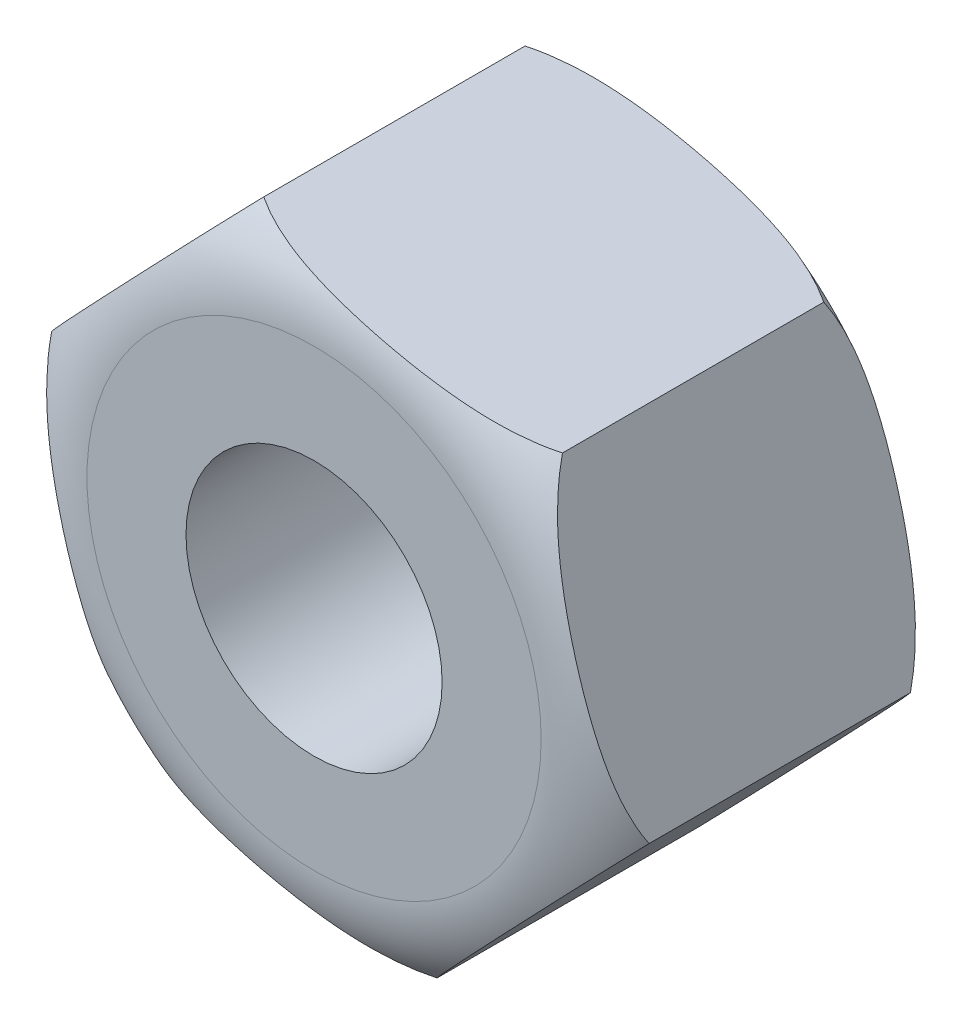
ISO-10303-21;
HEADER;
FILE_DESCRIPTION(('STEP AP214'),'2;1');
FILE_NAME('part.step','',(''),(''),'','','');
FILE_SCHEMA(('AUTOMOTIVE_DESIGN { 1 0 10303 214 1 1 1 1 }'));
ENDSEC;
DATA;
#1=APPLICATION_CONTEXT('core data for automotive mechanical design processes');
#2=APPLICATION_PROTOCOL_DEFINITION('international standard','automotive_design',2000,#1);
#3=PRODUCT_CONTEXT('',#1,'mechanical');
#4=PRODUCT('Part','Part','',(#3));
#5=PRODUCT_RELATED_PRODUCT_CATEGORY('part','',(#4));
#6=PRODUCT_DEFINITION_FORMATION('','',#4);
#7=PRODUCT_DEFINITION_CONTEXT('part definition',#1,'design');
#8=PRODUCT_DEFINITION('design','',#6,#7);
#9=PRODUCT_DEFINITION_SHAPE('','',#8);
#10=(LENGTH_UNIT() NAMED_UNIT(*) SI_UNIT(.MILLI.,.METRE.));
#11=(NAMED_UNIT(*) PLANE_ANGLE_UNIT() SI_UNIT($,.RADIAN.));
#12=(NAMED_UNIT(*) SI_UNIT($,.STERADIAN.) SOLID_ANGLE_UNIT());
#13=UNCERTAINTY_MEASURE_WITH_UNIT(LENGTH_MEASURE(1.E-05),#10,'distance_accuracy_value','');
#14=(GEOMETRIC_REPRESENTATION_CONTEXT(3) GLOBAL_UNCERTAINTY_ASSIGNED_CONTEXT((#13)) GLOBAL_UNIT_ASSIGNED_CONTEXT((#10,
#11,#12)) REPRESENTATION_CONTEXT('',''));
#15=CARTESIAN_POINT('',(0.,0.,0.));
#16=DIRECTION('',(0.,0.,1.));
#17=DIRECTION('',(1.,0.,0.));
#18=AXIS2_PLACEMENT_3D('',#15,#16,#17);
#19=CARTESIAN_POINT('',(0.,0.,8.));
#20=DIRECTION('',(0.,0.,1.));
#21=DIRECTION('',(1.,0.,0.));
#22=AXIS2_PLACEMENT_3D('',#19,#20,#21);
#23=TOROIDAL_SURFACE('',#22,17.,8.);
#24=CARTESIAN_POINT('',(-22.3612669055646,5.42193381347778,2.71895590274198));
#25=CARTESIAN_POINT('',(-22.3195071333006,5.27978053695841,2.63466784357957));
#26=CARTESIAN_POINT('',(-22.2771790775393,5.13569278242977,2.55401468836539));
#27=CARTESIAN_POINT('',(-22.1915556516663,4.84422446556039,2.39959197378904));
#28=CARTESIAN_POINT('',(-22.1482606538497,4.69684517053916,2.32581981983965));
#29=CARTESIAN_POINT('',(-22.0173247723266,4.25112998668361,2.11446776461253));
#30=CARTESIAN_POINT('',(-21.9284463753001,3.9485815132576,1.98648210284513));
#31=CARTESIAN_POINT('',(-21.74922202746,3.33848890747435,1.75409923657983));
#32=CARTESIAN_POINT('',(-21.6588965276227,3.03101439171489,1.64949979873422));
#33=CARTESIAN_POINT('',(-21.4766263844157,2.41055367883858,1.45945846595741));
#34=CARTESIAN_POINT('',(-21.3846809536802,2.09756480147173,1.3740261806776));
#35=CARTESIAN_POINT('',(-21.1557352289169,1.31821704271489,1.18302679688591));
#36=CARTESIAN_POINT('',(-21.0180932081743,0.84967367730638,1.0871917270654));
#37=CARTESIAN_POINT('',(-20.7414425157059,-0.0920652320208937,0.924137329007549));
#38=CARTESIAN_POINT('',(-20.6024331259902,-0.565263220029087,0.856933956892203));
#39=CARTESIAN_POINT('',(-20.3234054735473,-1.51509347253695,0.745217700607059));
#40=CARTESIAN_POINT('',(-20.1833856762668,-1.99173096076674,0.700754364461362));
#41=CARTESIAN_POINT('',(-19.9030172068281,-2.94612545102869,0.630373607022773));
#42=CARTESIAN_POINT('',(-19.7626686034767,-3.42388221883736,0.604452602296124));
#43=CARTESIAN_POINT('',(-19.4798247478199,-4.38670310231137,0.568103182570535));
#44=CARTESIAN_POINT('',(-19.33732727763,-4.87177476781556,0.557899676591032));
#45=CARTESIAN_POINT('',(-19.0522969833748,-5.84203844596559,0.55250107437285));
#46=CARTESIAN_POINT('',(-18.9097641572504,-6.32723046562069,0.557307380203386));
#47=CARTESIAN_POINT('',(-18.6250370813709,-7.29646196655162,0.582477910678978));
#48=CARTESIAN_POINT('',(-18.4828426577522,-7.78050203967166,0.602816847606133));
#49=CARTESIAN_POINT('',(-18.1987521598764,-8.74756658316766,0.661299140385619));
#50=CARTESIAN_POINT('',(-18.0568560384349,-9.23059121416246,0.699439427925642));
#51=CARTESIAN_POINT('',(-17.8439035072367,-9.95549698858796,0.773203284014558));
#52=CARTESIAN_POINT('',(-17.7726211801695,-10.1981471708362,0.800691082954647));
#53=CARTESIAN_POINT('',(-17.6302677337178,-10.6827285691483,0.861896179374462));
#54=CARTESIAN_POINT('',(-17.5591966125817,-10.924659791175,0.895613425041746));
#55=CARTESIAN_POINT('',(-17.4173013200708,-11.4076816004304,0.970062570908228));
#56=CARTESIAN_POINT('',(-17.3464773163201,-11.648771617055,1.01079853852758));
#57=CARTESIAN_POINT('',(-17.205227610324,-12.1295958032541,1.10014984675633));
#58=CARTESIAN_POINT('',(-17.1348019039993,-12.3693299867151,1.14876510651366));
#59=CARTESIAN_POINT('',(-16.9260284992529,-13.0800097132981,1.30656334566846));
#60=CARTESIAN_POINT('',(-16.7884210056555,-13.5484355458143,1.42857722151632));
#61=CARTESIAN_POINT('',(-16.5168816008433,-14.4727752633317,1.71556405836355));
#62=CARTESIAN_POINT('',(-16.382945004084,-14.9287050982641,1.88047913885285));
#63=CARTESIAN_POINT('',(-16.1877986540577,-15.5929973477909,2.16569221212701));
#64=CARTESIAN_POINT('',(-16.1242613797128,-15.809282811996,2.26599328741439));
#65=CARTESIAN_POINT('',(-15.9987150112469,-16.2366517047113,2.48122074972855));
#66=CARTESIAN_POINT('',(-15.9367175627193,-16.4476954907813,2.59623238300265));
#67=CARTESIAN_POINT('',(-15.8759045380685,-16.6547074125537,2.71895590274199));
#68=B_SPLINE_CURVE_WITH_KNOTS('',3,(#24,#25,#26,#27,#28,#29,#30,#31,#32,#33,#34,#35,#36,#37,#38,
#39,#40,#41,#42,#43,#44,#45,#46,#47,#48,#49,#50,#51,#52,#53,#54,#55,#56,#57,#58,#59,#60,#61,#62,
#63,#64,#65,#66,#67),.UNSPECIFIED.,.F.,.F.,(4,2,2,2,2,2,2,2,2,2,2,2,2,2,2,2,2,2,2,2,2,4),(0.,
0.51125033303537,1.02230710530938,2.04215259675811,3.05280490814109,4.06396279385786,
5.55575862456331,7.04838473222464,8.54424939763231,10.0398248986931,11.5566087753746,
13.0735343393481,14.5879955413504,16.1021958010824,16.8653123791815,17.6284226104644,
18.391976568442,19.1555226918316,20.6636990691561,22.1698511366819,22.9096082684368,
23.653864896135),.UNSPECIFIED.);
#69=CARTESIAN_POINT('',(-22.3612081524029,5.42173381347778,2.71883730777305));
#70=VERTEX_POINT('',#69);
#71=CARTESIAN_POINT('',(-15.875963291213,-16.6545074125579,2.71883730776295));
#72=VERTEX_POINT('',#71);
#73=EDGE_CURVE('E12',#70,#72,#68,.T.);
#74=ORIENTED_EDGE('',*,*,#73,.F.);
#75=CARTESIAN_POINT('',(-6.48504486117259,22.0764510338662,2.71900222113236));
#76=CARTESIAN_POINT('',(-6.48504797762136,22.0764477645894,2.71899965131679));
#77=CARTESIAN_POINT('',(-6.48505109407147,22.0764444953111,2.71899708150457));
#78=CARTESIAN_POINT('',(-6.68751561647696,21.8640512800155,2.55204594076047));
#79=CARTESIAN_POINT('',(-6.89564450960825,21.6457159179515,2.39923254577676));
#80=CARTESIAN_POINT('',(-7.31993754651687,21.2006159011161,2.11889330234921));
#81=CARTESIAN_POINT('',(-7.53610991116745,20.9738426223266,1.99139421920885));
#82=CARTESIAN_POINT('',(-7.97511211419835,20.5133121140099,1.75811345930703));
#83=CARTESIAN_POINT('',(-8.19796911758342,20.2795263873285,1.6524399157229));
#84=CARTESIAN_POINT('',(-8.64748798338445,19.8079634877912,1.4606820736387));
#85=CARTESIAN_POINT('',(-8.87414803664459,19.5701882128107,1.37458872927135));
#86=CARTESIAN_POINT('',(-9.43764886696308,18.9790537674,1.18255151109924));
#87=CARTESIAN_POINT('',(-9.77606844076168,18.6240383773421,1.08637711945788));
#88=CARTESIAN_POINT('',(-10.4562739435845,17.910476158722,0.922863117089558));
#89=CARTESIAN_POINT('',(-10.7980616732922,17.5519274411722,0.855539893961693));
#90=CARTESIAN_POINT('',(-11.484233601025,16.8321062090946,0.743716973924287));
#91=CARTESIAN_POINT('',(-11.8286221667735,16.4708291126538,0.699275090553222));
#92=CARTESIAN_POINT('',(-12.5182020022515,15.7474328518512,0.629061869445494));
#93=CARTESIAN_POINT('',(-12.8633931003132,15.3853138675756,0.603286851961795));
#94=CARTESIAN_POINT('',(-13.5558807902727,14.6588671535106,0.567508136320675));
#95=CARTESIAN_POINT('',(-13.9031792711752,14.294537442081,0.557584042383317));
#96=CARTESIAN_POINT('',(-14.5978577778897,13.5657924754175,0.552609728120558));
#97=CARTESIAN_POINT('',(-14.9452378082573,13.2013772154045,0.557560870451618));
#98=CARTESIAN_POINT('',(-15.6391383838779,12.4734483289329,0.58289634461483));
#99=CARTESIAN_POINT('',(-15.9856593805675,12.1099342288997,0.603254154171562));
#100=CARTESIAN_POINT('',(-16.6779753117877,11.3836676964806,0.66162898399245));
#101=CARTESIAN_POINT('',(-17.0237703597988,11.0209151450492,0.699642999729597));
#102=CARTESIAN_POINT('',(-17.5431605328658,10.4760545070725,0.773130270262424));
#103=CARTESIAN_POINT('',(-17.7173027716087,10.2933724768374,0.800554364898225));
#104=CARTESIAN_POINT('',(-18.0650727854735,9.92854810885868,0.861604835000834));
#105=CARTESIAN_POINT('',(-18.2387005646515,9.74640576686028,0.895231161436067));
#106=CARTESIAN_POINT('',(-18.5853615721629,9.38274478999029,0.969467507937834));
#107=CARTESIAN_POINT('',(-18.7583943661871,9.2012266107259,1.01008183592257));
#108=CARTESIAN_POINT('',(-19.1034906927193,8.83920704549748,1.0991524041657));
#109=CARTESIAN_POINT('',(-19.2755542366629,8.65870564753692,1.14760855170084));
#110=CARTESIAN_POINT('',(-19.7870302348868,8.12214728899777,1.30529679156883));
#111=CARTESIAN_POINT('',(-20.1246206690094,7.76800169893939,1.42743630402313));
#112=CARTESIAN_POINT('',(-20.7907788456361,7.06917567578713,1.71483547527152));
#113=CARTESIAN_POINT('',(-21.1193584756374,6.724482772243,1.88003497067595));
#114=CARTESIAN_POINT('',(-21.5982175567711,6.22214083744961,2.16592058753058));
#115=CARTESIAN_POINT('',(-21.7542362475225,6.05847111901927,2.266553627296));
#116=CARTESIAN_POINT('',(-22.0616489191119,5.73598318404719,2.48192380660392));
#117=CARTESIAN_POINT('',(-22.2130428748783,5.5771649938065,2.59666102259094));
#118=CARTESIAN_POINT('',(-22.361401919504,5.42153054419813,2.71899708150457));
#119=CARTESIAN_POINT('',(-22.3614050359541,5.42152727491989,2.71899965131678));
#120=CARTESIAN_POINT('',(-22.3614081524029,5.42152400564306,2.71900222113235));
#121=B_SPLINE_CURVE_WITH_KNOTS('',3,(#75,#76,#77,#78,#79,#80,#81,#82,#83,#84,#85,#86,#87,#88,
#89,#90,#91,#92,#93,#94,#95,#96,#97,#98,#99,#100,#101,#102,#103,#104,#105,#106,#107,#108,#109,
#110,#111,#112,#113,#114,#115,#116,#117,#118,#119,#120),.UNSPECIFIED.,.F.,.F.,(4,2,2,2,2,2,2,2,
2,2,2,2,2,2,2,2,2,2,2,2,2,2,4),(0.,1.55897205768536E-05,1.01280747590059,2.02666456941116,
3.04543024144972,4.06372429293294,5.56196799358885,7.061061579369,8.56392451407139,
10.0664911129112,11.5765802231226,13.0868076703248,14.5944411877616,16.101818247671,
16.8633679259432,17.6249115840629,18.3869264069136,19.1489322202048,20.660270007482,
22.1695073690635,22.9116382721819,23.653773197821,23.6537887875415),.UNSPECIFIED.);
#122=CARTESIAN_POINT('',(-6.48524486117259,22.0762412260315,2.71883730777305));
#123=VERTEX_POINT('',#122);
#124=EDGE_CURVE('E42',#123,#70,#121,.T.);
#125=ORIENTED_EDGE('',*,*,#124,.F.);
#126=CARTESIAN_POINT('',(15.8761632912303,16.6544589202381,2.71895439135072));
#127=CARTESIAN_POINT('',(15.7321750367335,16.6893705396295,2.63466637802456));
#128=CARTESIAN_POINT('',(15.5862273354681,16.7247572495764,2.55401326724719));
#129=CARTESIAN_POINT('',(15.2909966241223,16.7963393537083,2.39959063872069));
#130=CARTESIAN_POINT('',(15.1417148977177,16.8325344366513,2.3258185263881));
#131=CARTESIAN_POINT('',(14.6902462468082,16.9419982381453,2.11446659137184));
#132=CARTESIAN_POINT('',(14.3837923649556,17.0163015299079,1.98648100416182));
#133=CARTESIAN_POINT('',(13.765824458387,17.1661350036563,1.75409827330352));
#134=CARTESIAN_POINT('',(13.4543809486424,17.241648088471,1.64949889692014));
#135=CARTESIAN_POINT('',(12.8259111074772,17.3940278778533,1.45945767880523));
#136=CARTESIAN_POINT('',(12.5088820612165,17.4708952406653,1.3740254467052));
#137=CARTESIAN_POINT('',(11.7194740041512,17.662296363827,1.18302613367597));
#138=CARTESIAN_POINT('',(11.2448823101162,17.7773666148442,1.08719109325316));
#139=CARTESIAN_POINT('',(10.2909866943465,18.0086496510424,0.92413676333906));
#140=CARTESIAN_POINT('',(9.81168029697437,18.1248630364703,0.856933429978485));
#141=CARTESIAN_POINT('',(8.84958889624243,18.3581332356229,0.745217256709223));
#142=CARTESIAN_POINT('',(8.36679860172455,18.4751913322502,0.700753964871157));
#143=CARTESIAN_POINT('',(7.40008404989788,18.7095824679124,0.630373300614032));
#144=CARTESIAN_POINT('',(6.91616002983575,18.8269154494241,0.60445234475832));
#145=CARTESIAN_POINT('',(5.94091032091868,19.0633760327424,0.568103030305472));
#146=CARTESIAN_POINT('',(5.4495769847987,19.182505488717,0.557899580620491));
#147=CARTESIAN_POINT('',(4.46678841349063,19.4207939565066,0.552501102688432));
#148=CARTESIAN_POINT('',(3.97533317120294,19.539952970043,0.55730747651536));
#149=CARTESIAN_POINT('',(2.99359010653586,19.7779879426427,0.582478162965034));
#150=CARTESIAN_POINT('',(2.50330168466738,19.896864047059,0.602817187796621));
#151=CARTESIAN_POINT('',(1.52375355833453,20.1343668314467,0.661299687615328));
#152=CARTESIAN_POINT('',(1.03449369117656,20.2529935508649,0.699440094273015));
#153=CARTESIAN_POINT('',(0.30023047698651,20.4310241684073,0.773204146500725));
#154=CARTESIAN_POINT('',(0.0544481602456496,20.4906169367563,0.800692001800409));
#155=CARTESIAN_POINT('',(-0.436388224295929,20.609625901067,0.861897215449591));
#156=CARTESIAN_POINT('',(-0.681442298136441,20.6690420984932,0.895614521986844));
#157=CARTESIAN_POINT('',(-1.17069895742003,20.7876680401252,0.970063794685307));
#158=CARTESIAN_POINT('',(-1.41490096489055,20.8468776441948,1.01079982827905));
#159=CARTESIAN_POINT('',(-1.90193162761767,20.9649638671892,1.10015127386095));
#160=CARTESIAN_POINT('',(-2.14476029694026,21.0238404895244,1.14876660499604));
#161=CARTESIAN_POINT('',(-2.8646134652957,21.1983772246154,1.30656506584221));
#162=CARTESIAN_POINT('',(-3.33908572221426,21.3134185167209,1.42857910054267));
#163=CARTESIAN_POINT('',(-4.27535675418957,21.5404282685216,1.71556627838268));
#164=CARTESIAN_POINT('',(-4.73717168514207,21.6524006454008,1.88048154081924));
#165=CARTESIAN_POINT('',(-5.41003710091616,21.8155446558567,2.16569430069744));
#166=CARTESIAN_POINT('',(-5.62911295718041,21.868662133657,2.26599479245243));
#167=CARTESIAN_POINT('',(-6.06199554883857,21.9736195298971,2.48122089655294));
#168=CARTESIAN_POINT('',(-6.27576213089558,22.0254497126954,2.59623175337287));
#169=CARTESIAN_POINT('',(-6.4854448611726,22.0762897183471,2.71895439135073));
#170=B_SPLINE_CURVE_WITH_KNOTS('',3,(#126,#127,#128,#129,#130,#131,#132,#133,#134,#135,#136,
#137,#138,#139,#140,#141,#142,#143,#144,#145,#146,#147,#148,#149,#150,#151,#152,#153,#154,#155,
#156,#157,#158,#159,#160,#161,#162,#163,#164,#165,#166,#167,#168,#169),.UNSPECIFIED.,.F.,.F.,(4,
2,2,2,2,2,2,2,2,2,2,2,2,2,2,2,2,2,2,2,2,4),(0.,0.511250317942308,1.02230707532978,
2.04215253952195,3.05280484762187,4.0639627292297,5.55575922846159,7.04838600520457,
8.54425134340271,10.0398275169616,11.5566120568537,13.0735382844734,14.5880001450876,
16.1022010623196,16.8653174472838,17.6284274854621,18.3919812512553,19.1555271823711,
20.6637031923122,22.1698548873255,22.9096071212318,23.6538587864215),.UNSPECIFIED.);
#171=CARTESIAN_POINT('',(15.8759632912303,16.6545074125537,2.71883730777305));
#172=VERTEX_POINT('',#171);
#173=EDGE_CURVE('E144',#172,#123,#170,.T.);
#174=ORIENTED_EDGE('',*,*,#173,.F.);
#175=CARTESIAN_POINT('',(22.3612669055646,-5.42193381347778,2.71895590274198));
#176=CARTESIAN_POINT('',(22.3195071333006,-5.27978053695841,2.63466784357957));
#177=CARTESIAN_POINT('',(22.2771790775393,-5.13569278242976,2.55401468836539));
#178=CARTESIAN_POINT('',(22.1915556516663,-4.84422446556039,2.39959197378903));
#179=CARTESIAN_POINT('',(22.1482606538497,-4.69684517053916,2.32581981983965));
#180=CARTESIAN_POINT('',(22.0173247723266,-4.25112998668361,2.11446776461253));
#181=CARTESIAN_POINT('',(21.9284463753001,-3.94858151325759,1.98648210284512));
#182=CARTESIAN_POINT('',(21.74922202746,-3.33848890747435,1.75409923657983));
#183=CARTESIAN_POINT('',(21.6588965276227,-3.03101439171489,1.64949979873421));
#184=CARTESIAN_POINT('',(21.4766263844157,-2.41055367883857,1.45945846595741));
#185=CARTESIAN_POINT('',(21.3846809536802,-2.09756480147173,1.3740261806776));
#186=CARTESIAN_POINT('',(21.1557352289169,-1.31821704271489,1.18302679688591));
#187=CARTESIAN_POINT('',(21.0180932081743,-0.849673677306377,1.08719172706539));
#188=CARTESIAN_POINT('',(20.7414425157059,0.0920652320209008,0.924137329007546));
#189=CARTESIAN_POINT('',(20.6024331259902,0.565263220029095,0.8569339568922));
#190=CARTESIAN_POINT('',(20.3234054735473,1.51509347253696,0.745217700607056));
#191=CARTESIAN_POINT('',(20.1833856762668,1.99173096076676,0.700754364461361));
#192=CARTESIAN_POINT('',(19.903017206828,2.9461254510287,0.630373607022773));
#193=CARTESIAN_POINT('',(19.7626686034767,3.42388221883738,0.604452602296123));
#194=CARTESIAN_POINT('',(19.4798247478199,4.38670310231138,0.568103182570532));
#195=CARTESIAN_POINT('',(19.33732727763,4.87177476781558,0.557899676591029));
#196=CARTESIAN_POINT('',(19.0522969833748,5.84203844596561,0.552501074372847));
#197=CARTESIAN_POINT('',(18.9097641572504,6.32723046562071,0.557307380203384));
#198=CARTESIAN_POINT('',(18.6250370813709,7.29646196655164,0.582477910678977));
#199=CARTESIAN_POINT('',(18.4828426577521,7.78050203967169,0.602816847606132));
#200=CARTESIAN_POINT('',(18.1987521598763,8.74756658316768,0.661299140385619));
#201=CARTESIAN_POINT('',(18.0568560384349,9.23059121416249,0.699439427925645));
#202=CARTESIAN_POINT('',(17.8439035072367,9.95549698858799,0.773203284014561));
#203=CARTESIAN_POINT('',(17.7726211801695,10.1981471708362,0.800691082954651));
#204=CARTESIAN_POINT('',(17.6302677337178,10.6827285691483,0.861896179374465));
#205=CARTESIAN_POINT('',(17.5591966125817,10.924659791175,0.895613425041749));
#206=CARTESIAN_POINT('',(17.4173013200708,11.4076816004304,0.97006257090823));
#207=CARTESIAN_POINT('',(17.3464773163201,11.6487716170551,1.01079853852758));
#208=CARTESIAN_POINT('',(17.205227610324,12.1295958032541,1.10014984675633));
#209=CARTESIAN_POINT('',(17.1348019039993,12.3693299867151,1.14876510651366));
#210=CARTESIAN_POINT('',(16.9260284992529,13.0800097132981,1.30656334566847));
#211=CARTESIAN_POINT('',(16.7884210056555,13.5484355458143,1.42857722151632));
#212=CARTESIAN_POINT('',(16.5168816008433,14.4727752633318,1.71556405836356));
#213=CARTESIAN_POINT('',(16.382945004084,14.9287050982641,1.88047913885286));
#214=CARTESIAN_POINT('',(16.1877986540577,15.5929973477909,2.16569221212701));
#215=CARTESIAN_POINT('',(16.1242613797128,15.809282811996,2.26599328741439));
#216=CARTESIAN_POINT('',(15.9987150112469,16.2366517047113,2.48122074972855));
#217=CARTESIAN_POINT('',(15.9367175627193,16.4476954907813,2.59623238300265));
#218=CARTESIAN_POINT('',(15.8759045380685,16.6547074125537,2.71895590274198));
#219=B_SPLINE_CURVE_WITH_KNOTS('',3,(#175,#176,#177,#178,#179,#180,#181,#182,#183,#184,#185,
#186,#187,#188,#189,#190,#191,#192,#193,#194,#195,#196,#197,#198,#199,#200,#201,#202,#203,#204,
#205,#206,#207,#208,#209,#210,#211,#212,#213,#214,#215,#216,#217,#218),.UNSPECIFIED.,.F.,.F.,(4,
2,2,2,2,2,2,2,2,2,2,2,2,2,2,2,2,2,2,2,2,4),(0.,0.51125033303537,1.02230710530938,
2.04215259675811,3.05280490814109,4.06396279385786,5.55575862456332,7.04838473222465,
8.54424939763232,10.0398248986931,11.5566087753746,13.0735343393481,14.5879955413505,
16.1021958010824,16.8653123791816,17.6284226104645,18.391976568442,19.1555226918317,
20.6636990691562,22.169851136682,22.9096082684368,23.653864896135),.UNSPECIFIED.);
#220=CARTESIAN_POINT('',(22.3612081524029,-5.42173381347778,2.71883730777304));
#221=VERTEX_POINT('',#220);
#222=EDGE_CURVE('E150',#221,#172,#219,.T.);
#223=ORIENTED_EDGE('',*,*,#222,.F.);
#224=CARTESIAN_POINT('',(6.48504486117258,-22.0764510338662,2.71900222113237));
#225=CARTESIAN_POINT('',(6.48504797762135,-22.0764477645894,2.7189996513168));
#226=CARTESIAN_POINT('',(6.48505109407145,-22.0764444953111,2.71899708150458));
#227=CARTESIAN_POINT('',(6.68751561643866,-21.8640512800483,2.55204594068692));
#228=CARTESIAN_POINT('',(6.89564450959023,-21.6457159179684,2.39923254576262));
#229=CARTESIAN_POINT('',(7.31993754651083,-21.2006159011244,2.11889330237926));
#230=CARTESIAN_POINT('',(7.53610991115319,-20.9738426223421,1.99139421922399));
#231=CARTESIAN_POINT('',(7.97511211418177,-20.5133121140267,1.75811345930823));
#232=CARTESIAN_POINT('',(8.19796911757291,-20.2795263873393,1.65243991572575));
#233=CARTESIAN_POINT('',(8.64748798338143,-19.8079634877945,1.46068207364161));
#234=CARTESIAN_POINT('',(8.87414803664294,-19.5701882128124,1.37458872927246));
#235=CARTESIAN_POINT('',(9.43764886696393,-18.979053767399,1.18255151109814));
#236=CARTESIAN_POINT('',(9.77606844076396,-18.6240383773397,1.08637711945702));
#237=CARTESIAN_POINT('',(10.4562739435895,-17.9104761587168,0.922863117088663));
#238=CARTESIAN_POINT('',(10.7980616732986,-17.5519274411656,0.85553989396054));
#239=CARTESIAN_POINT('',(11.4842336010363,-16.8321062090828,0.743716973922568));
#240=CARTESIAN_POINT('',(11.8286221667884,-16.4708291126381,0.699275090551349));
#241=CARTESIAN_POINT('',(12.5182020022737,-15.7474328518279,0.62906186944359));
#242=CARTESIAN_POINT('',(12.863393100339,-15.3853138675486,0.603286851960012));
#243=CARTESIAN_POINT('',(13.5558807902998,-14.6588671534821,0.567508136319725));
#244=CARTESIAN_POINT('',(13.9031792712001,-14.2945374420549,0.557584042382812));
#245=CARTESIAN_POINT('',(14.5978577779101,-13.5657924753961,0.552609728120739));
#246=CARTESIAN_POINT('',(14.9452378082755,-13.2013772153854,0.557560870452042));
#247=CARTESIAN_POINT('',(15.6391383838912,-12.473448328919,0.582896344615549));
#248=CARTESIAN_POINT('',(15.9856593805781,-12.1099342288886,0.603254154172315));
#249=CARTESIAN_POINT('',(16.6779753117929,-11.3836676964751,0.661628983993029));
#250=CARTESIAN_POINT('',(17.0237703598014,-11.0209151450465,0.699642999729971));
#251=CARTESIAN_POINT('',(17.5431605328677,-10.4760545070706,0.773130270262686));
#252=CARTESIAN_POINT('',(17.7173027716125,-10.2933724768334,0.800554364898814));
#253=CARTESIAN_POINT('',(18.0650727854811,-9.92854810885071,0.861604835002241));
#254=CARTESIAN_POINT('',(18.238700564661,-9.74640576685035,0.895231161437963));
#255=CARTESIAN_POINT('',(18.5853615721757,-9.38274478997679,0.969467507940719));
#256=CARTESIAN_POINT('',(18.7583943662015,-9.2012266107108,1.01008183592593));
#257=CARTESIAN_POINT('',(19.1034906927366,-8.83920704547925,1.09915240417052));
#258=CARTESIAN_POINT('',(19.2755542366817,-8.65870564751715,1.14760855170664));
#259=CARTESIAN_POINT('',(19.7870302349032,-8.12214728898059,1.30529679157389));
#260=CARTESIAN_POINT('',(20.1246206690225,-7.76800169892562,1.42743630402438));
#261=CARTESIAN_POINT('',(20.7907788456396,-7.06917567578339,1.71483547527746));
#262=CARTESIAN_POINT('',(21.1193584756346,-6.72448277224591,1.88003497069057));
#263=CARTESIAN_POINT('',(21.5982175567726,-6.22214083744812,2.16592058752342));
#264=CARTESIAN_POINT('',(21.7542362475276,-6.05847111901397,2.26655362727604));
#265=CARTESIAN_POINT('',(22.0616489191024,-5.73598318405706,2.48192380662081));
#266=CARTESIAN_POINT('',(22.2130428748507,-5.57716499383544,2.59666102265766));
#267=CARTESIAN_POINT('',(22.361401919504,-5.42153054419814,2.71899708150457));
#268=CARTESIAN_POINT('',(22.3614050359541,-5.42152727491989,2.71899965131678));
#269=CARTESIAN_POINT('',(22.3614081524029,-5.42152400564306,2.71900222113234));
#270=B_SPLINE_CURVE_WITH_KNOTS('',3,(#224,#225,#226,#227,#228,#229,#230,#231,#232,#233,#234,
#235,#236,#237,#238,#239,#240,#241,#242,#243,#244,#245,#246,#247,#248,#249,#250,#251,#252,#253,
#254,#255,#256,#257,#258,#259,#260,#261,#262,#263,#264,#265,#266,#267,#268,#269),.UNSPECIFIED.,
.F.,.F.,(4,2,2,2,2,2,2,2,2,2,2,2,2,2,2,2,2,2,2,2,2,2,4),(0.,1.55897205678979E-05,
1.01280747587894,2.02666456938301,3.04543024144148,4.06372429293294,5.56196799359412,
7.06106157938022,8.5639245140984,10.0664911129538,11.5765802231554,13.0868076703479,
14.5944411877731,16.101818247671,16.8633679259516,17.6249115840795,18.3869264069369,
19.1489322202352,20.6602700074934,22.1695073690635,22.9116382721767,23.653773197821,
23.6537887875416),.UNSPECIFIED.);
#271=CARTESIAN_POINT('',(6.48524486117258,-22.0762412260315,2.71883730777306));
#272=VERTEX_POINT('',#271);
#273=EDGE_CURVE('E192',#272,#221,#270,.T.);
#274=ORIENTED_EDGE('',*,*,#273,.F.);
#275=CARTESIAN_POINT('',(-15.8761632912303,-16.6544589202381,2.71895439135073));
#276=CARTESIAN_POINT('',(-15.7321750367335,-16.6893705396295,2.63466637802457));
#277=CARTESIAN_POINT('',(-15.5862273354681,-16.7247572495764,2.55401326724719));
#278=CARTESIAN_POINT('',(-15.2909966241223,-16.7963393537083,2.3995906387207));
#279=CARTESIAN_POINT('',(-15.1417148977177,-16.8325344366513,2.3258185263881));
#280=CARTESIAN_POINT('',(-14.6902462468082,-16.9419982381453,2.11446659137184));
#281=CARTESIAN_POINT('',(-14.3837923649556,-17.0163015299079,1.98648100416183));
#282=CARTESIAN_POINT('',(-13.765824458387,-17.1661350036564,1.75409827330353));
#283=CARTESIAN_POINT('',(-13.4543809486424,-17.241648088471,1.64949889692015));
#284=CARTESIAN_POINT('',(-12.8259111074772,-17.3940278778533,1.45945767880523));
#285=CARTESIAN_POINT('',(-12.5088820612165,-17.4708952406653,1.37402544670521));
#286=CARTESIAN_POINT('',(-11.7194740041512,-17.662296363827,1.18302613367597));
#287=CARTESIAN_POINT('',(-11.2448823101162,-17.7773666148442,1.08719109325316));
#288=CARTESIAN_POINT('',(-10.2909866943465,-18.0086496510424,0.924136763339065));
#289=CARTESIAN_POINT('',(-9.81168029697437,-18.1248630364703,0.85693342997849));
#290=CARTESIAN_POINT('',(-8.84958889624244,-18.3581332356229,0.745217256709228));
#291=CARTESIAN_POINT('',(-8.36679860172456,-18.4751913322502,0.700753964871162));
#292=CARTESIAN_POINT('',(-7.40008404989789,-18.7095824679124,0.630373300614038));
#293=CARTESIAN_POINT('',(-6.91616002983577,-18.8269154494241,0.604452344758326));
#294=CARTESIAN_POINT('',(-5.9409103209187,-19.0633760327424,0.568103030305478));
#295=CARTESIAN_POINT('',(-5.44957698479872,-19.182505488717,0.557899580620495));
#296=CARTESIAN_POINT('',(-4.46678841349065,-19.4207939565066,0.552501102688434));
#297=CARTESIAN_POINT('',(-3.97533317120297,-19.539952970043,0.557307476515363));
#298=CARTESIAN_POINT('',(-2.99359010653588,-19.7779879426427,0.582478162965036));
#299=CARTESIAN_POINT('',(-2.50330168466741,-19.896864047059,0.602817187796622));
#300=CARTESIAN_POINT('',(-1.52375355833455,-20.1343668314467,0.66129968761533));
#301=CARTESIAN_POINT('',(-1.03449369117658,-20.2529935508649,0.699440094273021));
#302=CARTESIAN_POINT('',(-0.30023047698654,-20.4310241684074,0.773204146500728));
#303=CARTESIAN_POINT('',(-0.0544481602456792,-20.4906169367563,0.80069200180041));
#304=CARTESIAN_POINT('',(0.436388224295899,-20.609625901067,0.861897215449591));
#305=CARTESIAN_POINT('',(0.681442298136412,-20.6690420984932,0.895614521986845));
#306=CARTESIAN_POINT('',(1.17069895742,-20.7876680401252,0.970063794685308));
#307=CARTESIAN_POINT('',(1.41490096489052,-20.8468776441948,1.01079982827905));
#308=CARTESIAN_POINT('',(1.90193162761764,-20.9649638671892,1.10015127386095));
#309=CARTESIAN_POINT('',(2.14476029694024,-21.0238404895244,1.14876660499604));
#310=CARTESIAN_POINT('',(2.86461346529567,-21.1983772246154,1.30656506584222));
#311=CARTESIAN_POINT('',(3.33908572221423,-21.3134185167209,1.42857910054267));
#312=CARTESIAN_POINT('',(4.27535675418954,-21.5404282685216,1.71556627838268));
#313=CARTESIAN_POINT('',(4.73717168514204,-21.6524006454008,1.88048154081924));
#314=CARTESIAN_POINT('',(5.41003710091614,-21.8155446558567,2.16569430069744));
#315=CARTESIAN_POINT('',(5.62911295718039,-21.868662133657,2.26599479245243));
#316=CARTESIAN_POINT('',(6.06199554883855,-21.9736195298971,2.48122089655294));
#317=CARTESIAN_POINT('',(6.27576213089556,-22.0254497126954,2.59623175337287));
#318=CARTESIAN_POINT('',(6.48544486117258,-22.0762897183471,2.71895439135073));
#319=B_SPLINE_CURVE_WITH_KNOTS('',3,(#275,#276,#277,#278,#279,#280,#281,#282,#283,#284,#285,
#286,#287,#288,#289,#290,#291,#292,#293,#294,#295,#296,#297,#298,#299,#300,#301,#302,#303,#304,
#305,#306,#307,#308,#309,#310,#311,#312,#313,#314,#315,#316,#317,#318),.UNSPECIFIED.,.F.,.F.,(4,
2,2,2,2,2,2,2,2,2,2,2,2,2,2,2,2,2,2,2,2,4),(0.,0.511250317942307,1.02230707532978,
2.04215253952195,3.05280484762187,4.06396272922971,5.55575922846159,7.04838600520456,
8.5442513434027,10.0398275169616,11.5566120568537,13.0735382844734,14.5880001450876,
16.1022010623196,16.8653174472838,17.6284274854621,18.3919812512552,19.155527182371,
20.6637031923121,22.1698548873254,22.9096071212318,23.6538587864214),.UNSPECIFIED.);
#320=EDGE_CURVE('E198',#72,#272,#319,.T.);
#321=ORIENTED_EDGE('',*,*,#320,.F.);
#322=EDGE_LOOP('',(#74,#125,#174,#223,#274,#321));
#323=FACE_BOUND('',#322,.T.);
#324=CARTESIAN_POINT('',(0.,0.,0.));
#325=DIRECTION('',(0.,0.,1.));
#326=DIRECTION('',(1.,0.,0.));
#327=AXIS2_PLACEMENT_3D('',#324,#325,#326);
#328=CIRCLE('',#327,17.);
#329=CARTESIAN_POINT('',(17.,0.,0.));
#330=VERTEX_POINT('',#329);
#331=EDGE_CURVE('E203',#330,#330,#328,.F.);
#332=ORIENTED_EDGE('',*,*,#331,.F.);
#333=EDGE_LOOP('',(#332));
#334=FACE_BOUND('',#333,.T.);
#335=ADVANCED_FACE('F33',(#323,#334),#23,.T.);
#336=CARTESIAN_POINT('',(0.,0.,0.));
#337=DIRECTION('',(0.,0.,1.));
#338=DIRECTION('',(1.,0.,0.));
#339=AXIS2_PLACEMENT_3D('',#336,#337,#338);
#340=PLANE('',#339);
#341=CARTESIAN_POINT('',(0.,0.,0.));
#342=DIRECTION('',(0.,0.,1.));
#343=DIRECTION('',(1.,0.,0.));
#344=AXIS2_PLACEMENT_3D('',#341,#342,#343);
#345=CIRCLE('',#344,9.58612439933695);
#346=CARTESIAN_POINT('',(9.58612439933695,0.,0.));
#347=VERTEX_POINT('',#346);
#348=EDGE_CURVE('E37',#347,#347,#345,.F.);
#349=ORIENTED_EDGE('',*,*,#348,.F.);
#350=EDGE_LOOP('',(#349));
#351=FACE_BOUND('',#350,.T.);
#352=ORIENTED_EDGE('',*,*,#331,.T.);
#353=EDGE_LOOP('',(#352));
#354=FACE_BOUND('',#353,.T.);
#355=ADVANCED_FACE('F128',(#351,#354),#340,.F.);
#356=CARTESIAN_POINT('',(-15.8759632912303,-16.6545074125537,-10.));
#357=DIRECTION('',(0.959456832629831,0.28185561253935,0.));
#358=DIRECTION('',(-0.28185561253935,0.959456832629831,0.));
#359=AXIS2_PLACEMENT_3D('',#356,#357,#358);
#360=PLANE('',#359);
#361=CARTESIAN_POINT('',(-15.8759045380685,-16.6547074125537,22.281044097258));
#362=CARTESIAN_POINT('',(-15.9176643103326,-16.5125541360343,22.3653321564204));
#363=CARTESIAN_POINT('',(-15.9599923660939,-16.3684663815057,22.4459853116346));
#364=CARTESIAN_POINT('',(-16.0456157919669,-16.0769980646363,22.600408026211));
#365=CARTESIAN_POINT('',(-16.0889107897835,-15.9296187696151,22.6741801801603));
#366=CARTESIAN_POINT('',(-16.2198466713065,-15.4839035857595,22.8855322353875));
#367=CARTESIAN_POINT('',(-16.3087250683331,-15.1813551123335,23.0135178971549));
#368=CARTESIAN_POINT('',(-16.4879494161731,-14.5712625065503,23.2459007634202));
#369=CARTESIAN_POINT('',(-16.5782749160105,-14.2637879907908,23.3505002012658));
#370=CARTESIAN_POINT('',(-16.7605450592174,-13.6433272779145,23.5405415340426));
#371=CARTESIAN_POINT('',(-16.8524904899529,-13.3303384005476,23.6259738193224));
#372=CARTESIAN_POINT('',(-17.0814362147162,-12.5509906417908,23.8169732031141));
#373=CARTESIAN_POINT('',(-17.2190782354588,-12.0824472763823,23.9128082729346));
#374=CARTESIAN_POINT('',(-17.4957289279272,-11.140708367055,24.0758626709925));
#375=CARTESIAN_POINT('',(-17.6347383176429,-10.6675103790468,24.1430660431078));
#376=CARTESIAN_POINT('',(-17.9137659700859,-9.71768012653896,24.2547822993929));
#377=CARTESIAN_POINT('',(-18.0537857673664,-9.24104263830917,24.2992456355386));
#378=CARTESIAN_POINT('',(-18.3341542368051,-8.28664814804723,24.3696263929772));
#379=CARTESIAN_POINT('',(-18.4745028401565,-7.80889138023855,24.3955473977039));
#380=CARTESIAN_POINT('',(-18.7573466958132,-6.84607049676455,24.4318968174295));
#381=CARTESIAN_POINT('',(-18.8998441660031,-6.36099883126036,24.442100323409));
#382=CARTESIAN_POINT('',(-19.1848744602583,-5.39073515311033,24.4474989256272));
#383=CARTESIAN_POINT('',(-19.3274072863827,-4.90554313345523,24.4426926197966));
#384=CARTESIAN_POINT('',(-19.6121343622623,-3.93631163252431,24.417522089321));
#385=CARTESIAN_POINT('',(-19.754328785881,-3.45227155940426,24.3971831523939));
#386=CARTESIAN_POINT('',(-20.0384192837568,-2.48520701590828,24.3387008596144));
#387=CARTESIAN_POINT('',(-20.1803154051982,-2.00218238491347,24.3005605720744));
#388=CARTESIAN_POINT('',(-20.3932679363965,-1.27727661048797,24.2267967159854));
#389=CARTESIAN_POINT('',(-20.4645502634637,-1.03462642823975,24.1993089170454));
#390=CARTESIAN_POINT('',(-20.6069037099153,-0.550045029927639,24.1381038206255));
#391=CARTESIAN_POINT('',(-20.6779748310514,-0.308113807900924,24.1043865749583));
#392=CARTESIAN_POINT('',(-20.8198701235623,0.174908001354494,24.0299374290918));
#393=CARTESIAN_POINT('',(-20.890694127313,0.415998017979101,23.9892014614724));
#394=CARTESIAN_POINT('',(-21.0319438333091,0.896822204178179,23.8998501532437));
#395=CARTESIAN_POINT('',(-21.1023695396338,1.13655638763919,23.8512348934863));
#396=CARTESIAN_POINT('',(-21.3111429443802,1.84723611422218,23.6934366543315));
#397=CARTESIAN_POINT('',(-21.4487504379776,2.31566194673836,23.5714227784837));
#398=CARTESIAN_POINT('',(-21.7202898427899,3.24000166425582,23.2844359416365));
#399=CARTESIAN_POINT('',(-21.8542264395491,3.69593149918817,23.1195208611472));
#400=CARTESIAN_POINT('',(-22.0493727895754,4.36022374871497,22.834307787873));
#401=CARTESIAN_POINT('',(-22.1129100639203,4.57650921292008,22.7340067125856));
#402=CARTESIAN_POINT('',(-22.2384564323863,5.00387810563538,22.5187792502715));
#403=CARTESIAN_POINT('',(-22.3004538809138,5.21492189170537,22.4037676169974));
#404=CARTESIAN_POINT('',(-22.3612669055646,5.42193381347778,22.281044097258));
#405=B_SPLINE_CURVE_WITH_KNOTS('',3,(#361,#362,#363,#364,#365,#366,#367,#368,#369,#370,#371,
#372,#373,#374,#375,#376,#377,#378,#379,#380,#381,#382,#383,#384,#385,#386,#387,#388,#389,#390,
#391,#392,#393,#394,#395,#396,#397,#398,#399,#400,#401,#402,#403,#404),.UNSPECIFIED.,.F.,.F.,(4,
2,2,2,2,2,2,2,2,2,2,2,2,2,2,2,2,2,2,2,2,4),(0.,0.511250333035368,1.02230710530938,
2.04215259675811,3.05280490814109,4.06396279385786,5.55575862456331,7.04838473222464,
8.54424939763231,10.0398248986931,11.5566087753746,13.0735343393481,14.5879955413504,
16.1021958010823,16.8653123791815,17.6284226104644,18.3919765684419,19.1555226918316,
20.6636990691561,22.1698511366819,22.9096082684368,23.653864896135),.UNSPECIFIED.);
#406=CARTESIAN_POINT('',(-15.8759632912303,-16.6545074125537,22.2811626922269));
#407=VERTEX_POINT('',#406);
#408=CARTESIAN_POINT('',(-22.3612081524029,5.42173381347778,22.2811626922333));
#409=VERTEX_POINT('',#408);
#410=EDGE_CURVE('E94',#407,#409,#405,.T.);
#411=ORIENTED_EDGE('',*,*,#410,.T.);
#412=DIRECTION('',(0.,0.,1.));
#413=VECTOR('',#412,1.);
#414=CARTESIAN_POINT('',(-22.3612081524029,5.42173381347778,-10.));
#415=LINE('',#414,#413);
#416=EDGE_CURVE('E241',#70,#409,#415,.T.);
#417=ORIENTED_EDGE('',*,*,#416,.F.);
#418=ORIENTED_EDGE('',*,*,#73,.T.);
#419=DIRECTION('',(0.,0.,1.));
#420=VECTOR('',#419,1.);
#421=CARTESIAN_POINT('',(-15.8759632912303,-16.6545074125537,-10.));
#422=LINE('',#421,#420);
#423=EDGE_CURVE('E54',#72,#407,#422,.T.);
#424=ORIENTED_EDGE('',*,*,#423,.T.);
#425=EDGE_LOOP('',(#411,#417,#418,#424));
#426=FACE_BOUND('',#425,.T.);
#427=ADVANCED_FACE('F92',(#426),#360,.F.);
#428=CARTESIAN_POINT('',(-22.3612081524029,5.42173381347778,-10.));
#429=DIRECTION('',(0.723822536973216,-0.689986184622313,0.));
#430=DIRECTION('',(0.689986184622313,0.723822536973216,0.));
#431=AXIS2_PLACEMENT_3D('',#428,#429,#430);
#432=PLANE('',#431);
#433=CARTESIAN_POINT('',(-22.3614081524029,5.42152400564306,22.2809977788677));
#434=CARTESIAN_POINT('',(-22.3614050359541,5.42152727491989,22.2810003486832));
#435=CARTESIAN_POINT('',(-22.361401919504,5.42153054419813,22.2810029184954));
#436=CARTESIAN_POINT('',(-22.1589373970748,5.63392375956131,22.4479540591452));
#437=CARTESIAN_POINT('',(-21.9508085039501,5.8522591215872,22.6007674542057));
#438=CARTESIAN_POINT('',(-21.5265154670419,6.29735913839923,22.8811066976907));
#439=CARTESIAN_POINT('',(-21.3103431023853,6.52413241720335,23.0086057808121));
#440=CARTESIAN_POINT('',(-20.8713408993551,6.98466292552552,23.2418865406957));
#441=CARTESIAN_POINT('',(-20.648483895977,7.21844865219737,23.3475600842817));
#442=CARTESIAN_POINT('',(-20.1989650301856,7.69001155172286,23.5393179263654));
#443=CARTESIAN_POINT('',(-19.9723049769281,7.92778682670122,23.6254112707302));
#444=CARTESIAN_POINT('',(-19.4088041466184,8.51892127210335,23.8174484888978));
#445=CARTESIAN_POINT('',(-19.0703845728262,8.87393666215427,23.9136228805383));
#446=CARTESIAN_POINT('',(-18.3901790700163,9.5874988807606,24.0771368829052));
#447=CARTESIAN_POINT('',(-18.048391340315,9.94604759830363,24.1444601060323));
#448=CARTESIAN_POINT('',(-17.3622194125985,10.6658688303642,24.2562830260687));
#449=CARTESIAN_POINT('',(-17.0178308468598,11.0271459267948,24.3007249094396));
#450=CARTESIAN_POINT('',(-16.3282510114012,11.750542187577,24.3709381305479));
#451=CARTESIAN_POINT('',(-15.9830599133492,12.1126611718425,24.3967131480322));
#452=CARTESIAN_POINT('',(-15.290572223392,12.8391078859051,24.4324918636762));
#453=CARTESIAN_POINT('',(-14.9432737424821,13.2034375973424,24.442415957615));
#454=CARTESIAN_POINT('',(-14.2485952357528,13.9321825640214,24.44739027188));
#455=CARTESIAN_POINT('',(-13.9012152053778,14.2965978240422,24.4424391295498));
#456=CARTESIAN_POINT('',(-13.2073146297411,15.0245267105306,24.4171036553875));
#457=CARTESIAN_POINT('',(-12.8607936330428,15.388040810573,24.3967458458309));
#458=CARTESIAN_POINT('',(-12.1684777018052,16.1143073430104,24.3383710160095));
#459=CARTESIAN_POINT('',(-11.8226826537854,16.4770598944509,24.3003570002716));
#460=CARTESIAN_POINT('',(-11.3032924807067,17.0219205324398,24.2268697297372));
#461=CARTESIAN_POINT('',(-11.1291502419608,17.2046025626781,24.1994456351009));
#462=CARTESIAN_POINT('',(-10.7813802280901,17.569426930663,24.138395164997));
#463=CARTESIAN_POINT('',(-10.6077524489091,17.7515692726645,24.104768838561));
#464=CARTESIAN_POINT('',(-10.2610914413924,18.1152302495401,24.0305324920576));
#465=CARTESIAN_POINT('',(-10.0880586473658,18.296748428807,23.9899181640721));
#466=CARTESIAN_POINT('',(-9.74296232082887,18.6587679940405,23.9008475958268));
#467=CARTESIAN_POINT('',(-9.57089877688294,18.8392693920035,23.8523914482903));
#468=CARTESIAN_POINT('',(-9.05942277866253,19.3758277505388,23.6947032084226));
#469=CARTESIAN_POINT('',(-8.72183234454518,19.7299733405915,23.5725636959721));
#470=CARTESIAN_POINT('',(-8.05567416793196,20.4287993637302,23.285164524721));
#471=CARTESIAN_POINT('',(-7.72709453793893,20.7734922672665,23.1199650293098));
#472=CARTESIAN_POINT('',(-7.24823545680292,21.2758342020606,22.8340794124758));
#473=CARTESIAN_POINT('',(-7.09221676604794,21.4395039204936,22.7334463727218));
#474=CARTESIAN_POINT('',(-6.78480409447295,21.7619918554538,22.5180761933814));
#475=CARTESIAN_POINT('',(-6.63341013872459,21.9208100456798,22.4033389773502));
#476=CARTESIAN_POINT('',(-6.48505109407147,22.0764444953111,22.2810029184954));
#477=CARTESIAN_POINT('',(-6.48504797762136,22.0764477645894,22.2810003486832));
#478=CARTESIAN_POINT('',(-6.48504486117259,22.0764510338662,22.2809977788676));
#479=B_SPLINE_CURVE_WITH_KNOTS('',3,(#433,#434,#435,#436,#437,#438,#439,#440,#441,#442,#443,
#444,#445,#446,#447,#448,#449,#450,#451,#452,#453,#454,#455,#456,#457,#458,#459,#460,#461,#462,
#463,#464,#465,#466,#467,#468,#469,#470,#471,#472,#473,#474,#475,#476,#477,#478),.UNSPECIFIED.,
.F.,.F.,(4,2,2,2,2,2,2,2,2,2,2,2,2,2,2,2,2,2,2,2,2,2,4),(0.,1.55897205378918E-05,
1.01280747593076,2.02666456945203,3.04543024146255,4.06372429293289,5.56196799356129,
7.06106157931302,8.56392451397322,10.0664911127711,11.5765802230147,13.086807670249,
14.5944411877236,16.101818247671,16.8633679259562,17.6249115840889,18.3869264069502,
19.1489322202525,20.6602700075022,22.1695073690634,22.9116382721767,23.653773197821,
23.6537887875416),.UNSPECIFIED.);
#480=CARTESIAN_POINT('',(-6.48524486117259,22.0762412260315,22.2811626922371));
#481=VERTEX_POINT('',#480);
#482=EDGE_CURVE('E103',#409,#481,#479,.T.);
#483=ORIENTED_EDGE('',*,*,#482,.T.);
#484=DIRECTION('',(0.,0.,1.));
#485=VECTOR('',#484,1.);
#486=CARTESIAN_POINT('',(-6.48524486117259,22.0762412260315,-10.));
#487=LINE('',#486,#485);
#488=EDGE_CURVE('E238',#123,#481,#487,.T.);
#489=ORIENTED_EDGE('',*,*,#488,.F.);
#490=ORIENTED_EDGE('',*,*,#124,.T.);
#491=ORIENTED_EDGE('',*,*,#416,.T.);
#492=EDGE_LOOP('',(#483,#489,#490,#491));
#493=FACE_BOUND('',#492,.T.);
#494=ADVANCED_FACE('F127',(#493),#432,.F.);
#495=CARTESIAN_POINT('',(-6.48524486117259,22.0762412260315,-10.));
#496=DIRECTION('',(-0.235634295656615,-0.971841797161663,0.));
#497=DIRECTION('',(0.971841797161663,-0.235634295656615,0.));
#498=AXIS2_PLACEMENT_3D('',#495,#496,#497);
#499=PLANE('',#498);
#500=CARTESIAN_POINT('',(-6.4854448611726,22.0762897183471,22.2810456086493));
#501=CARTESIAN_POINT('',(-6.34145660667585,22.0413780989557,22.3653336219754));
#502=CARTESIAN_POINT('',(-6.19550890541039,22.0059913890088,22.4459867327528));
#503=CARTESIAN_POINT('',(-5.90027819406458,21.9344092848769,22.6004093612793));
#504=CARTESIAN_POINT('',(-5.75099646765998,21.8982142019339,22.6741814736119));
#505=CARTESIAN_POINT('',(-5.29952781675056,21.7887504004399,22.8855334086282));
#506=CARTESIAN_POINT('',(-4.9930739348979,21.7144471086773,23.0135189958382));
#507=CARTESIAN_POINT('',(-4.37510602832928,21.5646136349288,23.2459017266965));
#508=CARTESIAN_POINT('',(-4.06366251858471,21.4891005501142,23.3505011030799));
#509=CARTESIAN_POINT('',(-3.43519267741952,21.3367207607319,23.5405423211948));
#510=CARTESIAN_POINT('',(-3.1181636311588,21.2598533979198,23.6259745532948));
#511=CARTESIAN_POINT('',(-2.32875557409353,21.0684522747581,23.816973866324));
#512=CARTESIAN_POINT('',(-1.85416388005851,20.9533820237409,23.9128089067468));
#513=CARTESIAN_POINT('',(-0.900268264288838,20.7220989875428,24.0758632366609));
#514=CARTESIAN_POINT('',(-0.420961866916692,20.6058856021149,24.1430665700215));
#515=CARTESIAN_POINT('',(0.541129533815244,20.3726154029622,24.2547827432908));
#516=CARTESIAN_POINT('',(1.02391982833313,20.2555573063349,24.2992460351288));
#517=CARTESIAN_POINT('',(1.99063438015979,20.0211661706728,24.369626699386));
#518=CARTESIAN_POINT('',(2.47455840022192,19.9038331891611,24.3955476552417));
#519=CARTESIAN_POINT('',(3.44980810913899,19.6673726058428,24.4318969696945));
#520=CARTESIAN_POINT('',(3.94114144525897,19.5482431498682,24.4421004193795));
#521=CARTESIAN_POINT('',(4.92393001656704,19.3099546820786,24.4474988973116));
#522=CARTESIAN_POINT('',(5.41538525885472,19.1907956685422,24.4426925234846));
#523=CARTESIAN_POINT('',(6.39712832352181,18.9527606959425,24.417521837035));
#524=CARTESIAN_POINT('',(6.88741674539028,18.8338845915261,24.3971828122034));
#525=CARTESIAN_POINT('',(7.86696487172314,18.5963818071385,24.3387003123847));
#526=CARTESIAN_POINT('',(8.35622473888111,18.4777550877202,24.300559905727));
#527=CARTESIAN_POINT('',(9.09048795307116,18.2997244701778,24.2267958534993));
#528=CARTESIAN_POINT('',(9.33627026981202,18.2401317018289,24.1993079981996));
#529=CARTESIAN_POINT('',(9.8271066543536,18.1211227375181,24.1381027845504));
#530=CARTESIAN_POINT('',(10.0721607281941,18.0617065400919,24.1043854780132));
#531=CARTESIAN_POINT('',(10.5614173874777,17.94308059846,24.0299362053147));
#532=CARTESIAN_POINT('',(10.8056193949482,17.8838709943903,23.9892001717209));
#533=CARTESIAN_POINT('',(11.2926500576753,17.765784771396,23.899848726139));
#534=CARTESIAN_POINT('',(11.5354787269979,17.7069081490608,23.851233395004));
#535=CARTESIAN_POINT('',(12.2553318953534,17.5323714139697,23.6934349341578));
#536=CARTESIAN_POINT('',(12.7298041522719,17.4173301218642,23.5714208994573));
#537=CARTESIAN_POINT('',(13.6660751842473,17.1903203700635,23.2844337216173));
#538=CARTESIAN_POINT('',(14.1278901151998,17.0783479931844,23.1195184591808));
#539=CARTESIAN_POINT('',(14.8007555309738,16.9152039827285,22.8343056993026));
#540=CARTESIAN_POINT('',(15.0198313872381,16.8620865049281,22.7340052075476));
#541=CARTESIAN_POINT('',(15.4527139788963,16.757129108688,22.5187791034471));
#542=CARTESIAN_POINT('',(15.6664805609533,16.7052989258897,22.4037682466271));
#543=CARTESIAN_POINT('',(15.8761632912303,16.6544589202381,22.2810456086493));
#544=B_SPLINE_CURVE_WITH_KNOTS('',3,(#500,#501,#502,#503,#504,#505,#506,#507,#508,#509,#510,
#511,#512,#513,#514,#515,#516,#517,#518,#519,#520,#521,#522,#523,#524,#525,#526,#527,#528,#529,
#530,#531,#532,#533,#534,#535,#536,#537,#538,#539,#540,#541,#542,#543),.UNSPECIFIED.,.F.,.F.,(4,
2,2,2,2,2,2,2,2,2,2,2,2,2,2,2,2,2,2,2,2,4),(0.,0.511250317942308,1.02230707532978,
2.04215253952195,3.05280484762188,4.06396272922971,5.5557592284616,7.04838600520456,
8.54425134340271,10.0398275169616,11.5566120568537,13.0735382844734,14.5880001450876,
16.1022010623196,16.8653174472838,17.6284274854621,18.3919812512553,19.155527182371,
20.6637031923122,22.1698548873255,22.9096071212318,23.6538587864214),.UNSPECIFIED.);
#545=CARTESIAN_POINT('',(15.8759632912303,16.6545074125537,22.2811626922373));
#546=VERTEX_POINT('',#545);
#547=EDGE_CURVE('E107',#481,#546,#544,.T.);
#548=ORIENTED_EDGE('',*,*,#547,.T.);
#549=DIRECTION('',(0.,0.,1.));
#550=VECTOR('',#549,1.);
#551=CARTESIAN_POINT('',(15.8759632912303,16.6545074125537,-10.));
#552=LINE('',#551,#550);
#553=EDGE_CURVE('E233',#172,#546,#552,.T.);
#554=ORIENTED_EDGE('',*,*,#553,.F.);
#555=ORIENTED_EDGE('',*,*,#173,.T.);
#556=ORIENTED_EDGE('',*,*,#488,.T.);
#557=EDGE_LOOP('',(#548,#554,#555,#556));
#558=FACE_BOUND('',#557,.T.);
#559=ADVANCED_FACE('F157',(#558),#499,.F.);
#560=CARTESIAN_POINT('',(15.8759632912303,16.6545074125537,-10.));
#561=DIRECTION('',(-0.959456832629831,-0.28185561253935,0.));
#562=DIRECTION('',(0.28185561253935,-0.959456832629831,0.));
#563=AXIS2_PLACEMENT_3D('',#560,#561,#562);
#564=PLANE('',#563);
#565=CARTESIAN_POINT('',(15.8759045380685,16.6547074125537,22.281044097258));
#566=CARTESIAN_POINT('',(15.9176643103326,16.5125541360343,22.3653321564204));
#567=CARTESIAN_POINT('',(15.9599923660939,16.3684663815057,22.4459853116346));
#568=CARTESIAN_POINT('',(16.0456157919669,16.0769980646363,22.600408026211));
#569=CARTESIAN_POINT('',(16.0889107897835,15.9296187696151,22.6741801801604));
#570=CARTESIAN_POINT('',(16.2198466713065,15.4839035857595,22.8855322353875));
#571=CARTESIAN_POINT('',(16.3087250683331,15.1813551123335,23.0135178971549));
#572=CARTESIAN_POINT('',(16.4879494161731,14.5712625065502,23.2459007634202));
#573=CARTESIAN_POINT('',(16.5782749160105,14.2637879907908,23.3505002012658));
#574=CARTESIAN_POINT('',(16.7605450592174,13.6433272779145,23.5405415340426));
#575=CARTESIAN_POINT('',(16.8524904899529,13.3303384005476,23.6259738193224));
#576=CARTESIAN_POINT('',(17.0814362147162,12.5509906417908,23.8169732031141));
#577=CARTESIAN_POINT('',(17.2190782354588,12.0824472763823,23.9128082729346));
#578=CARTESIAN_POINT('',(17.4957289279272,11.140708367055,24.0758626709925));
#579=CARTESIAN_POINT('',(17.6347383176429,10.6675103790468,24.1430660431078));
#580=CARTESIAN_POINT('',(17.9137659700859,9.71768012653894,24.2547822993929));
#581=CARTESIAN_POINT('',(18.0537857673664,9.24104263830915,24.2992456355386));
#582=CARTESIAN_POINT('',(18.3341542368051,8.2866481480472,24.3696263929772));
#583=CARTESIAN_POINT('',(18.4745028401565,7.80889138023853,24.3955473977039));
#584=CARTESIAN_POINT('',(18.7573466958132,6.84607049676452,24.4318968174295));
#585=CARTESIAN_POINT('',(18.8998441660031,6.36099883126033,24.442100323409));
#586=CARTESIAN_POINT('',(19.1848744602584,5.3907351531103,24.4474989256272));
#587=CARTESIAN_POINT('',(19.3274072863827,4.9055431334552,24.4426926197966));
#588=CARTESIAN_POINT('',(19.6121343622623,3.93631163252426,24.417522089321));
#589=CARTESIAN_POINT('',(19.754328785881,3.45227155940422,24.3971831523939));
#590=CARTESIAN_POINT('',(20.0384192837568,2.48520701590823,24.3387008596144));
#591=CARTESIAN_POINT('',(20.1803154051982,2.00218238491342,24.3005605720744));
#592=CARTESIAN_POINT('',(20.3932679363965,1.27727661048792,24.2267967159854));
#593=CARTESIAN_POINT('',(20.4645502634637,1.0346264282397,24.1993089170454));
#594=CARTESIAN_POINT('',(20.6069037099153,0.55004502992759,24.1381038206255));
#595=CARTESIAN_POINT('',(20.6779748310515,0.308113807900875,24.1043865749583));
#596=CARTESIAN_POINT('',(20.8198701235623,-0.174908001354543,24.0299374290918));
#597=CARTESIAN_POINT('',(20.8906941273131,-0.415998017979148,23.9892014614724));
#598=CARTESIAN_POINT('',(21.0319438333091,-0.896822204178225,23.8998501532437));
#599=CARTESIAN_POINT('',(21.1023695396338,-1.13655638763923,23.8512348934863));
#600=CARTESIAN_POINT('',(21.3111429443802,-1.84723611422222,23.6934366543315));
#601=CARTESIAN_POINT('',(21.4487504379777,-2.31566194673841,23.5714227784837));
#602=CARTESIAN_POINT('',(21.7202898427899,-3.24000166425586,23.2844359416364));
#603=CARTESIAN_POINT('',(21.8542264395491,-3.69593149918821,23.1195208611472));
#604=CARTESIAN_POINT('',(22.0493727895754,-4.360223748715,22.834307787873));
#605=CARTESIAN_POINT('',(22.1129100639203,-4.5765092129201,22.7340067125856));
#606=CARTESIAN_POINT('',(22.2384564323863,-5.00387810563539,22.5187792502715));
#607=CARTESIAN_POINT('',(22.3004538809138,-5.21492189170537,22.4037676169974));
#608=CARTESIAN_POINT('',(22.3612669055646,-5.42193381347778,22.281044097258));
#609=B_SPLINE_CURVE_WITH_KNOTS('',3,(#565,#566,#567,#568,#569,#570,#571,#572,#573,#574,#575,
#576,#577,#578,#579,#580,#581,#582,#583,#584,#585,#586,#587,#588,#589,#590,#591,#592,#593,#594,
#595,#596,#597,#598,#599,#600,#601,#602,#603,#604,#605,#606,#607,#608),.UNSPECIFIED.,.F.,.F.,(4,
2,2,2,2,2,2,2,2,2,2,2,2,2,2,2,2,2,2,2,2,4),(0.,0.511250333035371,1.02230710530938,
2.04215259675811,3.05280490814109,4.06396279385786,5.55575862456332,7.04838473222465,
8.54424939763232,10.0398248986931,11.5566087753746,13.0735343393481,14.5879955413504,
16.1021958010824,16.8653123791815,17.6284226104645,18.391976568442,19.1555226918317,
20.6636990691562,22.169851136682,22.9096082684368,23.653864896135),.UNSPECIFIED.);
#610=CARTESIAN_POINT('',(22.3612081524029,-5.42173381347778,22.2811626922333));
#611=VERTEX_POINT('',#610);
#612=EDGE_CURVE('E170',#546,#611,#609,.T.);
#613=ORIENTED_EDGE('',*,*,#612,.T.);
#614=DIRECTION('',(0.,0.,1.));
#615=VECTOR('',#614,1.);
#616=CARTESIAN_POINT('',(22.3612081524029,-5.42173381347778,-10.));
#617=LINE('',#616,#615);
#618=EDGE_CURVE('E231',#221,#611,#617,.T.);
#619=ORIENTED_EDGE('',*,*,#618,.F.);
#620=ORIENTED_EDGE('',*,*,#222,.T.);
#621=ORIENTED_EDGE('',*,*,#553,.T.);
#622=EDGE_LOOP('',(#613,#619,#620,#621));
#623=FACE_BOUND('',#622,.T.);
#624=ADVANCED_FACE('F160',(#623),#564,.F.);
#625=CARTESIAN_POINT('',(22.3612081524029,-5.42173381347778,-10.));
#626=DIRECTION('',(-0.723822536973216,0.689986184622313,0.));
#627=DIRECTION('',(-0.689986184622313,-0.723822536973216,0.));
#628=AXIS2_PLACEMENT_3D('',#625,#626,#627);
#629=PLANE('',#628);
#630=CARTESIAN_POINT('',(22.3614081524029,-5.42152400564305,22.2809977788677));
#631=CARTESIAN_POINT('',(22.3614050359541,-5.42152727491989,22.2810003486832));
#632=CARTESIAN_POINT('',(22.361401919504,-5.42153054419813,22.2810029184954));
#633=CARTESIAN_POINT('',(22.1589373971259,-5.6339237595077,22.4479540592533));
#634=CARTESIAN_POINT('',(21.9508085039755,-5.85225912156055,22.6007674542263));
#635=CARTESIAN_POINT('',(21.5265154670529,-6.29735913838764,22.881106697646));
#636=CARTESIAN_POINT('',(21.3103431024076,-6.52413241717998,23.0086057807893));
#637=CARTESIAN_POINT('',(20.8713408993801,-6.98466292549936,23.2418865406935));
#638=CARTESIAN_POINT('',(20.6484838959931,-7.2184486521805,23.3475600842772));
#639=CARTESIAN_POINT('',(20.1989650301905,-7.69001155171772,23.539317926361));
#640=CARTESIAN_POINT('',(19.9723049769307,-7.92778682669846,23.6254112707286));
#641=CARTESIAN_POINT('',(19.4088041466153,-8.51892127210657,23.8174484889));
#642=CARTESIAN_POINT('',(19.0703845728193,-8.8739366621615,23.9136228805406));
#643=CARTESIAN_POINT('',(18.3901790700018,-9.58749888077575,24.077136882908));
#644=CARTESIAN_POINT('',(18.0483913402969,-9.94604759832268,24.1444601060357));
#645=CARTESIAN_POINT('',(17.3622194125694,-10.6658688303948,24.256283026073));
#646=CARTESIAN_POINT('',(17.0178308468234,-11.027145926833,24.3007249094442));
#647=CARTESIAN_POINT('',(16.3282510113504,-11.7505421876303,24.3709381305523));
#648=CARTESIAN_POINT('',(15.9830599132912,-12.1126611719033,24.3967131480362));
#649=CARTESIAN_POINT('',(15.2905722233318,-12.8391078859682,24.4324918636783));
#650=CARTESIAN_POINT('',(14.9432737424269,-13.2034375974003,24.4424159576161));
#651=CARTESIAN_POINT('',(14.2485952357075,-13.9321825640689,24.4473902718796));
#652=CARTESIAN_POINT('',(13.9012152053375,-14.2965978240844,24.4424391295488));
#653=CARTESIAN_POINT('',(13.2073146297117,-15.0245267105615,24.4171036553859));
#654=CARTESIAN_POINT('',(12.8607936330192,-15.3880408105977,24.3967458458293));
#655=CARTESIAN_POINT('',(12.1684777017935,-16.1143073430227,24.3383710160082));
#656=CARTESIAN_POINT('',(11.8226826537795,-16.4770598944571,24.3003570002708));
#657=CARTESIAN_POINT('',(11.3032924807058,-17.0219205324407,24.226869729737));
#658=CARTESIAN_POINT('',(11.1291502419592,-17.2046025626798,24.1994456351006));
#659=CARTESIAN_POINT('',(10.7813802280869,-17.5694269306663,24.1383951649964));
#660=CARTESIAN_POINT('',(10.6077524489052,-17.7515692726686,24.1047688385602));
#661=CARTESIAN_POINT('',(10.2610914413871,-18.1152302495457,24.0305324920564));
#662=CARTESIAN_POINT('',(10.0880586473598,-18.2967484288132,23.9899181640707));
#663=CARTESIAN_POINT('',(9.74296232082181,-18.6587679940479,23.9008475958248));
#664=CARTESIAN_POINT('',(9.57089877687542,-18.8392693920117,23.8523914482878));
#665=CARTESIAN_POINT('',(9.05942277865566,-19.3758277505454,23.6947032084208));
#666=CARTESIAN_POINT('',(8.72183234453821,-19.7299733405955,23.5725636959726));
#667=CARTESIAN_POINT('',(8.05567416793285,-20.4287993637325,23.2851645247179));
#668=CARTESIAN_POINT('',(7.7270945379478,-20.7734922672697,23.1199650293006));
#669=CARTESIAN_POINT('',(7.24823545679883,-21.2758342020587,22.8340794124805));
#670=CARTESIAN_POINT('',(7.0922167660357,-21.4395039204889,22.7334463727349));
#671=CARTESIAN_POINT('',(6.78480409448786,-21.7619918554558,22.5180761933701));
#672=CARTESIAN_POINT('',(6.63341013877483,-21.9208100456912,22.403338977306));
#673=CARTESIAN_POINT('',(6.48505109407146,-22.0764444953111,22.2810029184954));
#674=CARTESIAN_POINT('',(6.48504797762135,-22.0764477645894,22.2810003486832));
#675=CARTESIAN_POINT('',(6.48504486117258,-22.0764510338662,22.2809977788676));
#676=B_SPLINE_CURVE_WITH_KNOTS('',3,(#630,#631,#632,#633,#634,#635,#636,#637,#638,#639,#640,
#641,#642,#643,#644,#645,#646,#647,#648,#649,#650,#651,#652,#653,#654,#655,#656,#657,#658,#659,
#660,#661,#662,#663,#664,#665,#666,#667,#668,#669,#670,#671,#672,#673,#674,#675),.UNSPECIFIED.,
.F.,.F.,(4,2,2,2,2,2,2,2,2,2,2,2,2,2,2,2,2,2,2,2,2,2,4),(0.,1.55897205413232E-05,
1.01280747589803,2.02666456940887,3.04543024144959,4.06372429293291,5.56196799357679,
7.06106157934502,8.56392451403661,10.0664911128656,11.5765802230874,13.0868076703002,
14.5944411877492,16.101818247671,16.8633679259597,17.6249115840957,18.3869264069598,
19.1489322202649,20.660270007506,22.1695073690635,22.9116382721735,23.653773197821,
23.6537887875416),.UNSPECIFIED.);
#677=CARTESIAN_POINT('',(6.4852448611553,-22.0762412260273,22.2811626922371));
#678=VERTEX_POINT('',#677);
#679=EDGE_CURVE('E88',#611,#678,#676,.T.);
#680=ORIENTED_EDGE('',*,*,#679,.T.);
#681=DIRECTION('',(0.,0.,1.));
#682=VECTOR('',#681,1.);
#683=CARTESIAN_POINT('',(6.48524486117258,-22.0762412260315,-10.));
#684=LINE('',#683,#682);
#685=EDGE_CURVE('E49',#272,#678,#684,.T.);
#686=ORIENTED_EDGE('',*,*,#685,.F.);
#687=ORIENTED_EDGE('',*,*,#273,.T.);
#688=ORIENTED_EDGE('',*,*,#618,.T.);
#689=EDGE_LOOP('',(#680,#686,#687,#688));
#690=FACE_BOUND('',#689,.T.);
#691=ADVANCED_FACE('F186',(#690),#629,.F.);
#692=CARTESIAN_POINT('',(6.48524486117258,-22.0762412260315,-10.));
#693=DIRECTION('',(0.235634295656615,0.971841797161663,0.));
#694=DIRECTION('',(-0.971841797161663,0.235634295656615,0.));
#695=AXIS2_PLACEMENT_3D('',#692,#693,#694);
#696=PLANE('',#695);
#697=CARTESIAN_POINT('',(6.48544486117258,-22.0762897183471,22.2810456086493));
#698=CARTESIAN_POINT('',(6.34145660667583,-22.0413780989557,22.3653336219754));
#699=CARTESIAN_POINT('',(6.19550890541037,-22.0059913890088,22.4459867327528));
#700=CARTESIAN_POINT('',(5.90027819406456,-21.9344092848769,22.6004093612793));
#701=CARTESIAN_POINT('',(5.75099646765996,-21.8982142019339,22.6741814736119));
#702=CARTESIAN_POINT('',(5.29952781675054,-21.7887504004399,22.8855334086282));
#703=CARTESIAN_POINT('',(4.99307393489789,-21.7144471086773,23.0135189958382));
#704=CARTESIAN_POINT('',(4.37510602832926,-21.5646136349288,23.2459017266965));
#705=CARTESIAN_POINT('',(4.06366251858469,-21.4891005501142,23.3505011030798));
#706=CARTESIAN_POINT('',(3.4351926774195,-21.3367207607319,23.5405423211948));
#707=CARTESIAN_POINT('',(3.11816363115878,-21.2598533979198,23.6259745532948));
#708=CARTESIAN_POINT('',(2.32875557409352,-21.0684522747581,23.816973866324));
#709=CARTESIAN_POINT('',(1.85416388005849,-20.9533820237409,23.9128089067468));
#710=CARTESIAN_POINT('',(0.900268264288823,-20.7220989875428,24.0758632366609));
#711=CARTESIAN_POINT('',(0.420961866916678,-20.6058856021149,24.1430665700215));
#712=CARTESIAN_POINT('',(-0.541129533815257,-20.3726154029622,24.2547827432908));
#713=CARTESIAN_POINT('',(-1.02391982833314,-20.255557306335,24.2992460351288));
#714=CARTESIAN_POINT('',(-1.9906343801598,-20.0211661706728,24.369626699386));
#715=CARTESIAN_POINT('',(-2.47455840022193,-19.9038331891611,24.3955476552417));
#716=CARTESIAN_POINT('',(-3.449808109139,-19.6673726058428,24.4318969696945));
#717=CARTESIAN_POINT('',(-3.94114144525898,-19.5482431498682,24.4421004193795));
#718=CARTESIAN_POINT('',(-4.92393001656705,-19.3099546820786,24.4474988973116));
#719=CARTESIAN_POINT('',(-5.41538525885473,-19.1907956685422,24.4426925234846));
#720=CARTESIAN_POINT('',(-6.39712832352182,-18.9527606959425,24.417521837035));
#721=CARTESIAN_POINT('',(-6.88741674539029,-18.8338845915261,24.3971828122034));
#722=CARTESIAN_POINT('',(-7.86696487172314,-18.5963818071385,24.3387003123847));
#723=CARTESIAN_POINT('',(-8.35622473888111,-18.4777550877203,24.300559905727));
#724=CARTESIAN_POINT('',(-9.09048795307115,-18.2997244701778,24.2267958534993));
#725=CARTESIAN_POINT('',(-9.33627026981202,-18.2401317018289,24.1993079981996));
#726=CARTESIAN_POINT('',(-9.82710665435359,-18.1211227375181,24.1381027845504));
#727=CARTESIAN_POINT('',(-10.0721607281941,-18.0617065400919,24.1043854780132));
#728=CARTESIAN_POINT('',(-10.5614173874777,-17.94308059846,24.0299362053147));
#729=CARTESIAN_POINT('',(-10.8056193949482,-17.8838709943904,23.9892001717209));
#730=CARTESIAN_POINT('',(-11.2926500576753,-17.765784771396,23.899848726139));
#731=CARTESIAN_POINT('',(-11.5354787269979,-17.7069081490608,23.851233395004));
#732=CARTESIAN_POINT('',(-12.2553318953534,-17.5323714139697,23.6934349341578));
#733=CARTESIAN_POINT('',(-12.7298041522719,-17.4173301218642,23.5714208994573));
#734=CARTESIAN_POINT('',(-13.6660751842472,-17.1903203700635,23.2844337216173));
#735=CARTESIAN_POINT('',(-14.1278901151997,-17.0783479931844,23.1195184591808));
#736=CARTESIAN_POINT('',(-14.8007555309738,-16.9152039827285,22.8343056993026));
#737=CARTESIAN_POINT('',(-15.0198313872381,-16.8620865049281,22.7340052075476));
#738=CARTESIAN_POINT('',(-15.4527139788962,-16.757129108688,22.5187791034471));
#739=CARTESIAN_POINT('',(-15.6664805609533,-16.7052989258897,22.4037682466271));
#740=CARTESIAN_POINT('',(-15.8761632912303,-16.6544589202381,22.2810456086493));
#741=B_SPLINE_CURVE_WITH_KNOTS('',3,(#697,#698,#699,#700,#701,#702,#703,#704,#705,#706,#707,
#708,#709,#710,#711,#712,#713,#714,#715,#716,#717,#718,#719,#720,#721,#722,#723,#724,#725,#726,
#727,#728,#729,#730,#731,#732,#733,#734,#735,#736,#737,#738,#739,#740),.UNSPECIFIED.,.F.,.F.,(4,
2,2,2,2,2,2,2,2,2,2,2,2,2,2,2,2,2,2,2,2,4),(0.,0.51125031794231,1.02230707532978,
2.04215253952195,3.05280484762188,4.06396272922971,5.5557592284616,7.04838600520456,
8.54425134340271,10.0398275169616,11.5566120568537,13.0735382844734,14.5880001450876,
16.1022010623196,16.8653174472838,17.6284274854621,18.3919812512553,19.155527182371,
20.6637031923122,22.1698548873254,22.9096071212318,23.6538587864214),.UNSPECIFIED.);
#742=EDGE_CURVE('E83',#678,#407,#741,.T.);
#743=ORIENTED_EDGE('',*,*,#742,.T.);
#744=ORIENTED_EDGE('',*,*,#423,.F.);
#745=ORIENTED_EDGE('',*,*,#320,.T.);
#746=ORIENTED_EDGE('',*,*,#685,.T.);
#747=EDGE_LOOP('',(#743,#744,#745,#746));
#748=FACE_BOUND('',#747,.T.);
#749=ADVANCED_FACE('F84',(#748),#696,.F.);
#750=CARTESIAN_POINT('',(0.,0.,25.));
#751=DIRECTION('',(0.,0.,1.));
#752=DIRECTION('',(1.,0.,0.));
#753=AXIS2_PLACEMENT_3D('',#750,#751,#752);
#754=PLANE('',#753);
#755=CARTESIAN_POINT('',(0.,0.,25.));
#756=DIRECTION('',(0.,0.,-1.));
#757=DIRECTION('',(-1.,0.,0.));
#758=AXIS2_PLACEMENT_3D('',#755,#756,#757);
#759=CIRCLE('',#758,9.58612439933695);
#760=CARTESIAN_POINT('',(-9.58612439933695,0.,25.));
#761=VERTEX_POINT('',#760);
#762=EDGE_CURVE('E89',#761,#761,#759,.T.);
#763=ORIENTED_EDGE('',*,*,#762,.T.);
#764=EDGE_LOOP('',(#763));
#765=FACE_BOUND('',#764,.T.);
#766=CARTESIAN_POINT('',(0.,0.,25.));
#767=DIRECTION('',(0.,0.,1.));
#768=DIRECTION('',(1.,0.,0.));
#769=AXIS2_PLACEMENT_3D('',#766,#767,#768);
#770=CIRCLE('',#769,17.);
#771=CARTESIAN_POINT('',(17.,0.,25.));
#772=VERTEX_POINT('',#771);
#773=EDGE_CURVE('E106',#772,#772,#770,.T.);
#774=ORIENTED_EDGE('',*,*,#773,.T.);
#775=EDGE_LOOP('',(#774));
#776=FACE_BOUND('',#775,.T.);
#777=ADVANCED_FACE('F210',(#765,#776),#754,.T.);
#778=CARTESIAN_POINT('',(0.,0.,17.));
#779=DIRECTION('',(0.,0.,1.));
#780=DIRECTION('',(1.,0.,0.));
#781=AXIS2_PLACEMENT_3D('',#778,#779,#780);
#782=TOROIDAL_SURFACE('',#781,17.,8.);
#783=ORIENTED_EDGE('',*,*,#410,.F.);
#784=ORIENTED_EDGE('',*,*,#742,.F.);
#785=ORIENTED_EDGE('',*,*,#679,.F.);
#786=ORIENTED_EDGE('',*,*,#612,.F.);
#787=ORIENTED_EDGE('',*,*,#547,.F.);
#788=ORIENTED_EDGE('',*,*,#482,.F.);
#789=EDGE_LOOP('',(#783,#784,#785,#786,#787,#788));
#790=FACE_BOUND('',#789,.T.);
#791=ORIENTED_EDGE('',*,*,#773,.F.);
#792=EDGE_LOOP('',(#791));
#793=FACE_BOUND('',#792,.T.);
#794=ADVANCED_FACE('F100',(#790,#793),#782,.T.);
#795=CARTESIAN_POINT('',(0.,0.,-10.));
#796=DIRECTION('',(0.,0.,1.));
#797=DIRECTION('',(1.,0.,0.));
#798=AXIS2_PLACEMENT_3D('',#795,#796,#797);
#799=CYLINDRICAL_SURFACE('',#798,9.58612439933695);
#800=ORIENTED_EDGE('',*,*,#762,.F.);
#801=EDGE_LOOP('',(#800));
#802=FACE_BOUND('',#801,.T.);
#803=ORIENTED_EDGE('',*,*,#348,.T.);
#804=EDGE_LOOP('',(#803));
#805=FACE_BOUND('',#804,.T.);
#806=ADVANCED_FACE('F131',(#802,#805),#799,.F.);
#807=CLOSED_SHELL('',(#335,#355,#427,#494,#559,#624,#691,#749,#777,#794,#806));
#808=MANIFOLD_SOLID_BREP('B2',#807);
#809=ADVANCED_BREP_SHAPE_REPRESENTATION('',(#18,#808),#14);
#810=SHAPE_DEFINITION_REPRESENTATION(#9,#809);
ENDSEC;
END-ISO-10303-21;
